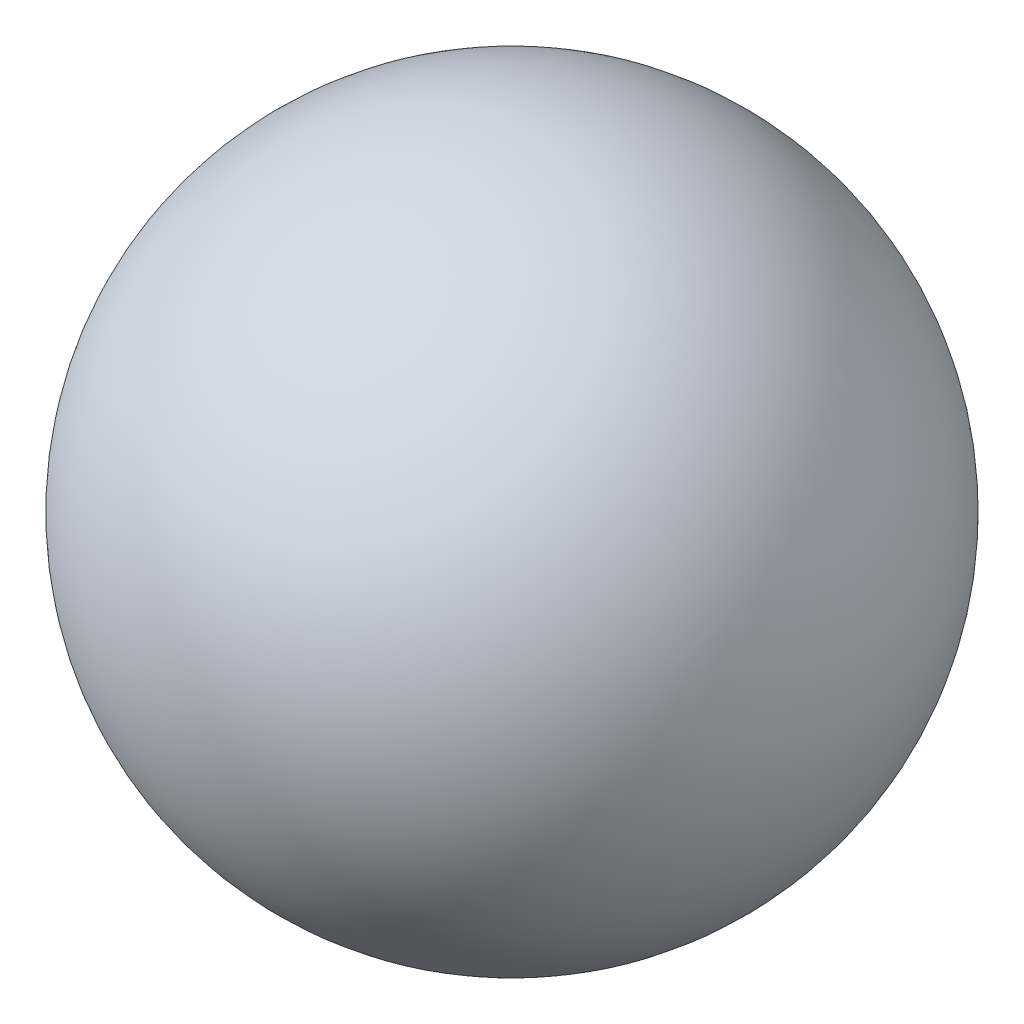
from build123d import *


with BuildPart() as part:
    # Esquisse1 → Base-R_volution (revolve)
    with BuildSketch(Plane.XY):
        with BuildLine():
            Line((0, 9.738294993), (0, 2.738294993))
            ThreePointArc((0, 2.738294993), (3.5, 6.238294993), (0, 9.738294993))
        make_face()
    revolve(axis=Axis((0, 0, 0), (0, 1, 0)))


solid = part.part
